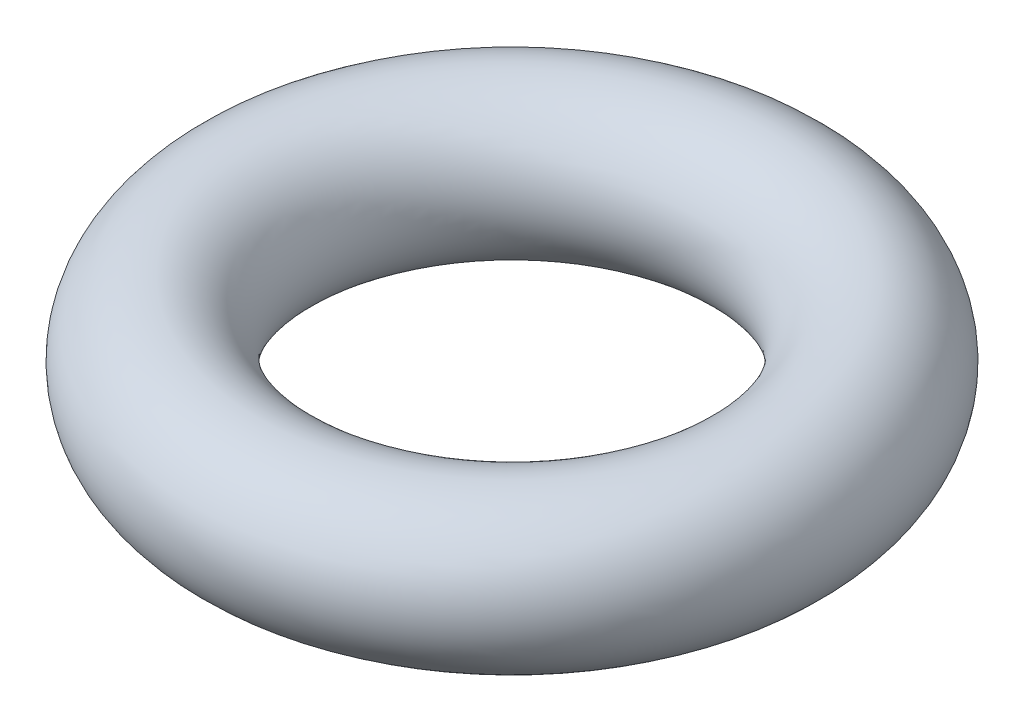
from build123d import *

# Parameters (mm, degrees)
ESQUISSE1_R = 0.8


with BuildPart() as part:
    # Esquisse1 → R_volution1 (revolve)
    with BuildSketch(Plane.XY, mode=Mode.PRIVATE) as r_volution1_sk:
        with Locations((2.7, 0)):
            Circle(ESQUISSE1_R)
    revolve(r_volution1_sk.sketch.rotate(Axis((0, 0, 0), (0, 1, 0)), 90), axis=Axis((0, 0, 0), (0, 1, 0)))


solid = part.part
